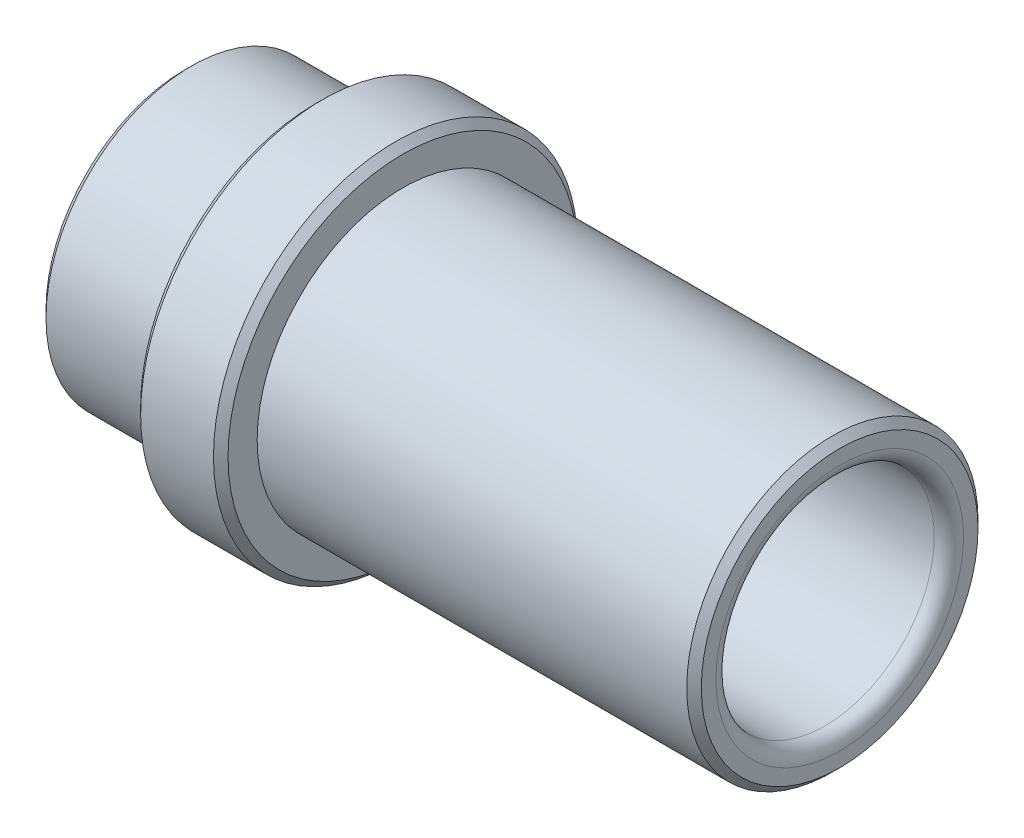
from build123d import *

# Parameters (mm, degrees)
CHANFREIN1_SIZE = 0.5
CONG_1_R        = 1


with BuildPart() as part:
    # Esquisse1 → R_volution1 (revolve)
    with BuildSketch(Plane.XY, mode=Mode.PRIVATE) as r_volution1_sk:
        Polygon((0, 7.5), (0, 10), (9, 10), (9, 12.5), (15, 12.5), (15, 10), (45, 10), (45, 7.5), align=None)
    revolve(r_volution1_sk.sketch.rotate(Axis((-64.639502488, 0, 0), (1, 0, 0)), 90), axis=Axis((-64.639502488, 0, 0), (1, 0, 0)))

    # Chanfrein1
    chanfrein1_edges = [part.edges().sort_by_distance(p)[0] for p in [
        (45, 0, -10),
        (15, 0, -12.5),
        (9, 0, -12.5),
        (0, 0, -10),
    ]]
    chamfer(chanfrein1_edges, length=CHANFREIN1_SIZE)

    # Cong_1
    cong_1_edges = [part.edges().sort_by_distance(p)[0] for p in [
        (45, 0, -7.5),
        (0, 0, -7.5),
    ]]
    fillet(cong_1_edges, radius=CONG_1_R)


solid = part.part
